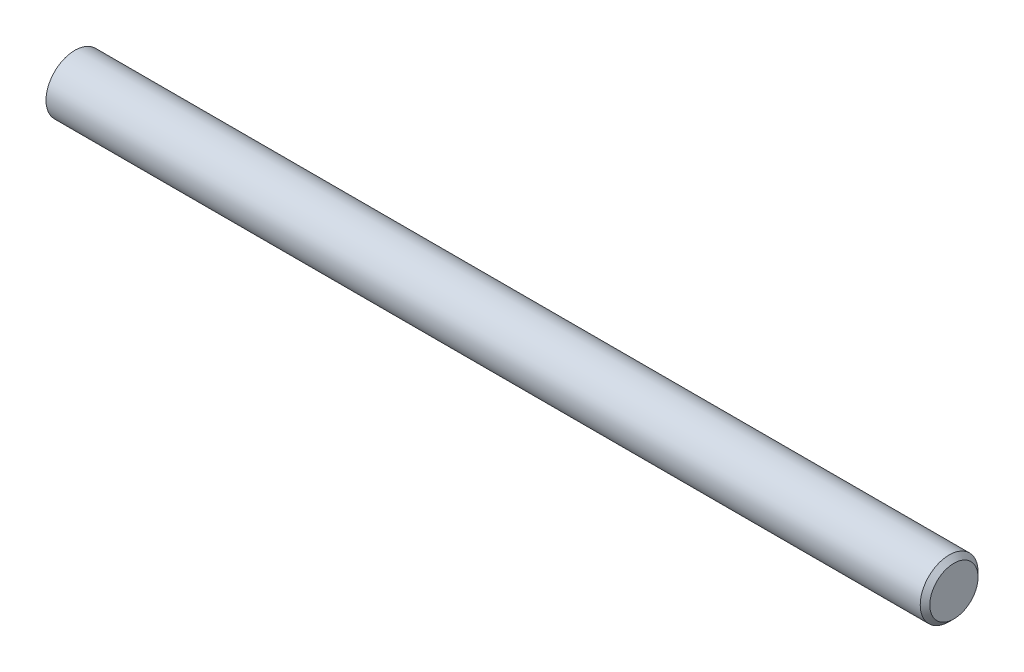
ISO-10303-21;
HEADER;
FILE_DESCRIPTION(('STEP AP214'),'2;1');
FILE_NAME('part.step','',(''),(''),'','','');
FILE_SCHEMA(('AUTOMOTIVE_DESIGN { 1 0 10303 214 1 1 1 1 }'));
ENDSEC;
DATA;
#1=APPLICATION_CONTEXT('core data for automotive mechanical design processes');
#2=APPLICATION_PROTOCOL_DEFINITION('international standard','automotive_design',2000,#1);
#3=PRODUCT_CONTEXT('',#1,'mechanical');
#4=PRODUCT('Part','Part','',(#3));
#5=PRODUCT_RELATED_PRODUCT_CATEGORY('part','',(#4));
#6=PRODUCT_DEFINITION_FORMATION('','',#4);
#7=PRODUCT_DEFINITION_CONTEXT('part definition',#1,'design');
#8=PRODUCT_DEFINITION('design','',#6,#7);
#9=PRODUCT_DEFINITION_SHAPE('','',#8);
#10=(LENGTH_UNIT() NAMED_UNIT(*) SI_UNIT(.MILLI.,.METRE.));
#11=(NAMED_UNIT(*) PLANE_ANGLE_UNIT() SI_UNIT($,.RADIAN.));
#12=(NAMED_UNIT(*) SI_UNIT($,.STERADIAN.) SOLID_ANGLE_UNIT());
#13=UNCERTAINTY_MEASURE_WITH_UNIT(LENGTH_MEASURE(1.E-05),#10,'distance_accuracy_value','');
#14=(GEOMETRIC_REPRESENTATION_CONTEXT(3) GLOBAL_UNCERTAINTY_ASSIGNED_CONTEXT((#13)) GLOBAL_UNIT_ASSIGNED_CONTEXT((#10,
#11,#12)) REPRESENTATION_CONTEXT('',''));
#15=CARTESIAN_POINT('',(0.,0.,0.));
#16=DIRECTION('',(0.,0.,1.));
#17=DIRECTION('',(1.,0.,0.));
#18=AXIS2_PLACEMENT_3D('',#15,#16,#17);
#19=CARTESIAN_POINT('',(0.,0.,0.));
#20=DIRECTION('',(-1.,0.,0.));
#21=DIRECTION('',(0.,0.,1.));
#22=AXIS2_PLACEMENT_3D('',#19,#20,#21);
#23=PLANE('',#22);
#24=CARTESIAN_POINT('',(0.,0.,0.));
#25=DIRECTION('',(-1.,0.,0.));
#26=DIRECTION('',(0.,0.,1.));
#27=AXIS2_PLACEMENT_3D('',#24,#25,#26);
#28=CIRCLE('',#27,5.);
#29=CARTESIAN_POINT('',(0.,0.,5.));
#30=VERTEX_POINT('',#29);
#31=EDGE_CURVE('E10',#30,#30,#28,.T.);
#32=ORIENTED_EDGE('',*,*,#31,.T.);
#33=EDGE_LOOP('',(#32));
#34=FACE_BOUND('',#33,.T.);
#35=ADVANCED_FACE('F31',(#34),#23,.T.);
#36=CARTESIAN_POINT('',(-31.75,0.,0.));
#37=DIRECTION('',(-1.,0.,0.));
#38=DIRECTION('',(0.,0.,1.));
#39=AXIS2_PLACEMENT_3D('',#36,#37,#38);
#40=CYLINDRICAL_SURFACE('',#39,5.);
#41=CARTESIAN_POINT('',(151.172,0.,0.));
#42=DIRECTION('',(-1.,0.,0.));
#43=DIRECTION('',(0.,0.,1.));
#44=AXIS2_PLACEMENT_3D('',#41,#42,#43);
#45=CIRCLE('',#44,5.);
#46=CARTESIAN_POINT('',(151.172,0.,5.));
#47=VERTEX_POINT('',#46);
#48=EDGE_CURVE('E37',#47,#47,#45,.T.);
#49=ORIENTED_EDGE('',*,*,#48,.T.);
#50=EDGE_LOOP('',(#49));
#51=FACE_BOUND('',#50,.T.);
#52=ORIENTED_EDGE('',*,*,#31,.F.);
#53=EDGE_LOOP('',(#52));
#54=FACE_BOUND('',#53,.T.);
#55=ADVANCED_FACE('F56',(#51,#54),#40,.T.);
#56=CARTESIAN_POINT('',(152.,0.,0.));
#57=DIRECTION('',(-1.,0.,0.));
#58=DIRECTION('',(0.,0.,1.));
#59=AXIS2_PLACEMENT_3D('',#56,#57,#58);
#60=CONICAL_SURFACE('',#59,4.17200000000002,0.785398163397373);
#61=ORIENTED_EDGE('',*,*,#48,.F.);
#62=EDGE_LOOP('',(#61));
#63=FACE_BOUND('',#62,.T.);
#64=CARTESIAN_POINT('',(152.,0.,0.));
#65=DIRECTION('',(-1.,0.,0.));
#66=DIRECTION('',(0.,0.,1.));
#67=AXIS2_PLACEMENT_3D('',#64,#65,#66);
#68=CIRCLE('',#67,4.17200000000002);
#69=CARTESIAN_POINT('',(152.,0.,4.17200000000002));
#70=VERTEX_POINT('',#69);
#71=EDGE_CURVE('E41',#70,#70,#68,.T.);
#72=ORIENTED_EDGE('',*,*,#71,.T.);
#73=EDGE_LOOP('',(#72));
#74=FACE_BOUND('',#73,.T.);
#75=ADVANCED_FACE('F48',(#63,#74),#60,.T.);
#76=CARTESIAN_POINT('',(152.,4.17200000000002,0.));
#77=DIRECTION('',(1.,0.,0.));
#78=DIRECTION('',(0.,0.,-1.));
#79=AXIS2_PLACEMENT_3D('',#76,#77,#78);
#80=PLANE('',#79);
#81=ORIENTED_EDGE('',*,*,#71,.F.);
#82=EDGE_LOOP('',(#81));
#83=FACE_BOUND('',#82,.T.);
#84=ADVANCED_FACE('F50',(#83),#80,.T.);
#85=CLOSED_SHELL('',(#35,#55,#75,#84));
#86=MANIFOLD_SOLID_BREP('B2',#85);
#87=ADVANCED_BREP_SHAPE_REPRESENTATION('',(#18,#86),#14);
#88=SHAPE_DEFINITION_REPRESENTATION(#9,#87);
ENDSEC;
END-ISO-10303-21;
